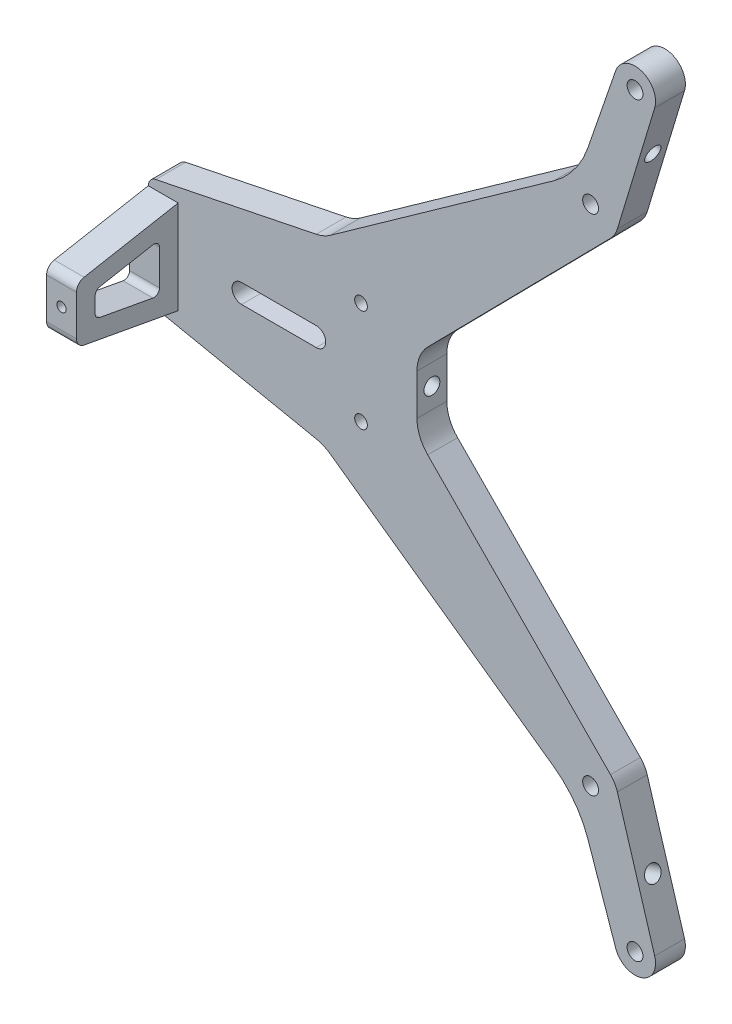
from build123d import *

# Parameters (mm, degrees)
BOSS_EXTRU_1_DEPTH      = 8
TROU_TARAUD_M102_D      = 8.5
TROU_TARAUD_M103_D      = 8.5
TROU_TARAUD_M103_DEPTH  = 25
TROU_TARAUD_M103_TIP    = 2.553657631
ENL_V_MAT_EXTRU_1_REACH = 305.811
BOSS_EXTRU_2_DEPTH      = 16
CONG_2_R                = 3
CONG_3_R                = 5
TROU_TARAUD_M63_D       = 5
TROU_TARAUD_M63_DEPTH   = 10


with BuildPart() as part:
    # Esquisse1 → Boss.-Extru.1 (new, symmetric)
    with BuildSketch(Plane.XY):
        with BuildLine():
            Line((-218, 25), (-218, 15))
            Line((-218, 15), (-202, 15))
            Line((-202, 15), (-202, -15))
            Line((-202, -15), (-218, -15))
            Line((-218, -15), (-218, -25))
            ThreePointArc((-218, -25), (-216.873801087, -28.161275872), (-214.002533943, -29.898461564))
            Line((-214.002533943, -29.898461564), (-128, -47.5))
            ThreePointArc((-128, -47.5), (-124.036743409, -48.751953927), (-120.417833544, -50.796038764))
            Line((-120.417833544, -50.796038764), (-0.69665804, -135.951299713))
            ThreePointArc((-0.69665804, -135.951299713), (10.3638666, -146.750937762), (17.596967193, -160.412915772))
            Line((17.596967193, -160.412915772), (32.465948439, -203.582238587))
            ThreePointArc((32.465948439, -203.582238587), (46.249076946, -210.466943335), (53.396009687, -196.817945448))
            Line((53.396009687, -196.817945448), (33.403456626, -130.660834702))
            ThreePointArc((33.403456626, -130.660834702), (31.943147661, -127.342842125), (29.729483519, -124.472081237))
            Line((29.729483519, -124.472081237), (-68.246273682, -25.037225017))
            ThreePointArc((-68.246273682, -25.037225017), (-72.505748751, -18.585332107), (-74, -11))
            Line((-74, -11), (-74, 11))
            ThreePointArc((-74, 11), (-72.505748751, 18.585332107), (-68.246273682, 25.037225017))
            Line((-68.246273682, 25.037225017), (29.729483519, 124.472081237))
            ThreePointArc((29.729483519, 124.472081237), (31.943147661, 127.342842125), (33.403456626, 130.660834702))
            Line((33.403456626, 130.660834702), (53.396009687, 196.817945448))
            ThreePointArc((53.396009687, 196.817945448), (46.249076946, 210.466943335), (32.465948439, 203.582238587))
            Line((32.465948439, 203.582238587), (17.596967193, 160.412915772))
            ThreePointArc((17.596967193, 160.412915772), (10.3638666, 146.750937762), (-0.69665804, 135.951299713))
            Line((-0.69665804, 135.951299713), (-120.417833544, 50.796038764))
            ThreePointArc((-120.417833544, 50.796038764), (-124.036743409, 48.751953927), (-128, 47.5))
            Line((-128, 47.5), (-214.002533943, 29.898461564))
            ThreePointArc((-214.002533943, 29.898461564), (-216.873801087, 28.161275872), (-218, 25))
        make_face()
    extrude(amount=BOSS_EXTRU_1_DEPTH, both=True)

    # Esquisse15 → Trou taraud_ M105 (revolve, cut)
    with BuildSketch(Plane(origin=(22.481837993, 174.595230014, 0), x_dir=(-0.3256580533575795, -0.9454876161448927, 0), z_dir=(0, 0, 1))):
        Polygon((0, 0), (0, 266.453657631), (4.25, 263.9), (4.25, 0), align=None)
    trou_taraud_m105 = revolve(axis=Axis((16.477991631, 176.663158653, 0), (0.9454876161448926, -0.3256580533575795, 0)), mode=Mode.SUBTRACT)

    # Trou taraud_ M102 (through all)
    with Locations(Plane.XY.offset(8)):
        with Locations((42.866312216, 200), (19.044778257, 135)):
            trou_taraud_m102 = Hole(TROU_TARAUD_M102_D / 2)

    # Esquisse8 → Trou taraud_ M81 (revolve, cut)
    with BuildSketch(Plane(origin=(-104, 27.5, 8), x_dir=(0, -1, 0), z_dir=(1, 0, 0))):
        Polygon((0, 0), (0, 24.292926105), (3.4, 22.25), (3.4, 0), align=None)
    trou_taraud_m81 = revolve(axis=Axis((-104, 27.5, 14.35), (0, 0, -1)), mode=Mode.SUBTRACT)

    # Sym_trie1: Trou taraud_ M105, Trou taraud_ M102, Trou taraud_ M81 across plane
    add(trou_taraud_m105.mirror(Plane.ZX), mode=Mode.SUBTRACT)
    add(trou_taraud_m102.mirror(Plane.ZX), mode=Mode.SUBTRACT)
    add(trou_taraud_m81.mirror(Plane.ZX), mode=Mode.SUBTRACT)

    # Trou taraud_ M103
    with Locations(Plane(origin=(-74, 0, 0), x_dir=(0, 0, -1), z_dir=(1, 0, 0))):
        with Locations((0, 0)):
            Hole(TROU_TARAUD_M103_D / 2, depth=TROU_TARAUD_M103_DEPTH)
            with Locations((0, 0, -(TROU_TARAUD_M103_DEPTH + TROU_TARAUD_M103_TIP / 2))):  # 118° drill point
                Cone(0, TROU_TARAUD_M103_D / 2, TROU_TARAUD_M103_TIP, mode=Mode.SUBTRACT)

    # Esquisse12 → Enl_v. mat.-Extru.1 (cut, up to next)
    with BuildSketch(Plane.XY.offset(8), mode=Mode.PRIVATE) as enl_v_mat_extru_1_sk1:
        with BuildLine():
            Line((-168, 5.1), (-128, 5.1))
            ThreePointArc((-128, 5.1), (-122.9, 0), (-128, -5.1))
            Line((-128, -5.1), (-168, -5.1))
            ThreePointArc((-168, -5.1), (-173.1, 0), (-168, 5.1))
        make_face()
    enl_v_mat_extru_1_tool1 = extrude(enl_v_mat_extru_1_sk1.sketch, amount=-ENL_V_MAT_EXTRU_1_REACH, mode=Mode.PRIVATE) & part.part
    add(enl_v_mat_extru_1_tool1.solids().sort_by_distance((-148, 0, 8))[0], mode=Mode.SUBTRACT)

    # Esquisse19 → Boss.-Extru.2 (add)
    with BuildSketch(Plane.ZY.offset(218)):
        Polygon((8, -25), (8, -15), (-3, -15), (-3, 15), (8, 15), (8, 25), (62.5, 15), (62.5, -15), align=None)
        Polygon((18, -12.998195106), (18, 12.998195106), (52.5, 6.667919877), (52.5, -6.667919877), align=None, mode=Mode.SUBTRACT)
    extrude(amount=-BOSS_EXTRU_2_DEPTH)

    # Cong_2
    cong_2_edges = [part.edges().sort_by_distance(p)[0] for p in [
        (-210, -12.998195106, 18),
        (-210, 12.998195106, 18),
        (-210, 6.667919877, 52.5),
        (-210, -6.667919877, 52.5),
    ]]
    fillet(cong_2_edges, radius=CONG_2_R)

    # Cong_3
    cong_3_edges = [part.edges().sort_by_distance(p)[0] for p in [
        (-210, -15, 62.5),
        (-210, 15, 62.5),
    ]]
    fillet(cong_3_edges, radius=CONG_3_R)

    # Trou taraud_ M63
    with Locations(Plane.XY.offset(62.5)):
        with Locations((-210, 0)):
            Hole(TROU_TARAUD_M63_D / 2, depth=TROU_TARAUD_M63_DEPTH)


solid = part.part
